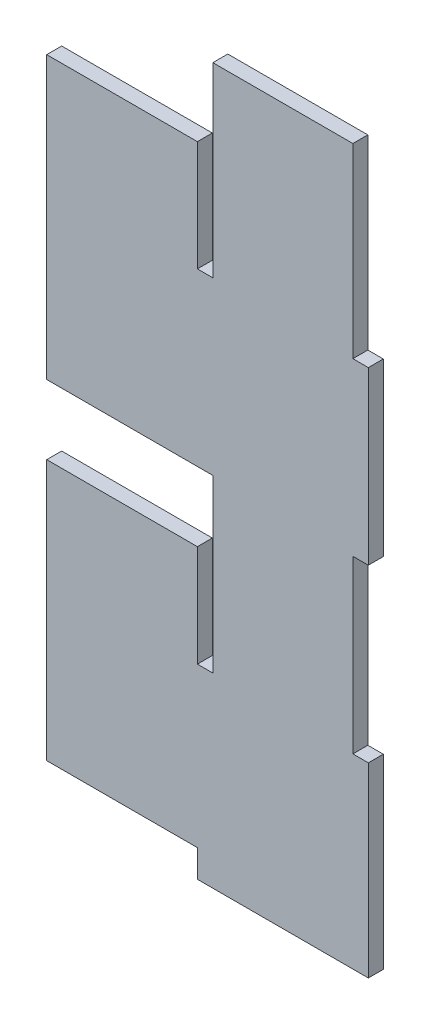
from build123d import *

# Parameters (mm, degrees)
SALIENTE_EXTRUIR1_DEPTH = 3


with BuildPart() as part:
    # Croquis1 → Saliente-Extruir1 (new, symmetric)
    with BuildSketch(Plane.XY):
        Polygon((-6.2, -5.42), (62.4, -5.42), (62.4, 69.36), (56.2, 69.36), (56.2, 138.04), (62.4, 138.04), (62.4, 206.72), (56.2, 206.72), (56.2, 281.5), (0, 281.5), (0, 206.72), (-6.2, 206.72), (-6.2, 250.951201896), (-66.66782321, 250.951201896), (-66.66782321, 138.04), (-6.2, 138.04), (0, 138.04), (0, 69.36), (-6.2, 69.36), (-6.2, 110.191945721), (-66.66782321, 110.191945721), (-66.66782321, 5.58), (-6.2, 5.58), align=None)
    extrude(amount=SALIENTE_EXTRUIR1_DEPTH, both=True)


solid = part.part
